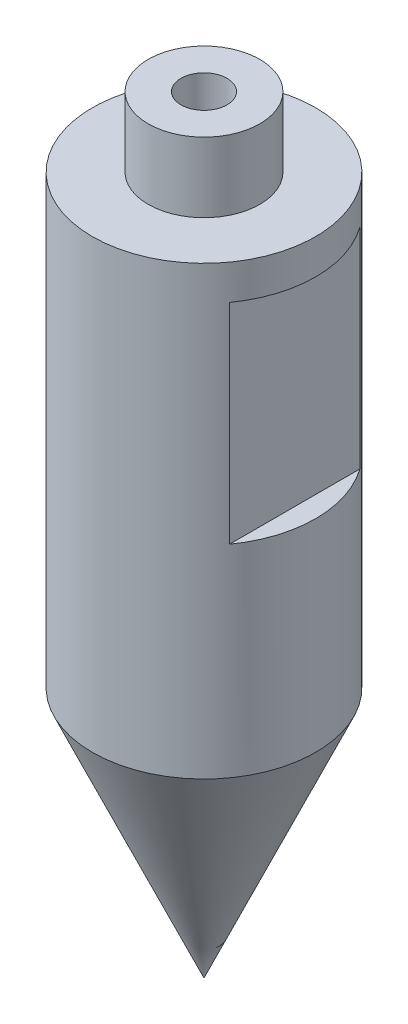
from build123d import *

# Parameters (mm, degrees)
SKETCH_10_R              = 4
EXTRUDE_1_DEPTH          = 5
CUT_EXTRUDE_1_DEPTH      = 52.264022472
CUT_EXTRUDE_1_DEPTH_BACK = 52.264022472
SKETCH_19_W              = 40
SKETCH_19_H              = 15
HOLE_WIZARD_M4_1_D       = 3.3
HOLE_WIZARD_M4_1_DEPTH   = 10.1
HOLE_WIZARD_M4_1_TIP     = 0.991420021


with BuildPart() as part:
    # Sketch 1 → Revolve 1 (revolve)
    with BuildSketch(Plane.XY, mode=Mode.PRIVATE) as revolve_1_sk:
        Polygon((0, 0), (-8, 0), (-8, -32), (0, -50), align=None)
    revolve(revolve_1_sk.sketch.rotate(Axis((0, -50, 0), (0, 1, 0)), 270), axis=Axis((0, -50, 0), (0, 1, 0)))

    # Sketch 10 → Extrude 1 (add)
    with BuildSketch(Plane(origin=(0, 0, 0), x_dir=(1, 0, 0), z_dir=(0, 1, 0))):
        with Locations(Location((0, 0, 0), (0, 0, 270))):
            Circle(SKETCH_10_R)
    extrude(amount=EXTRUDE_1_DEPTH)

    # Sketch 19 → Cut-Extrude 1 (cut, two sides: drawn at the far end of the back side and taken through both)
    with BuildSketch(Plane.XY.offset(-CUT_EXTRUDE_1_DEPTH_BACK)):
        with Locations((26.5, -10)):
            Rectangle(SKETCH_19_W, SKETCH_19_H)
        with Locations((-26.5, -10)):
            Rectangle(SKETCH_19_W, SKETCH_19_H)
    extrude(amount=CUT_EXTRUDE_1_DEPTH + CUT_EXTRUDE_1_DEPTH_BACK, mode=Mode.SUBTRACT)

    # Hole Wizard M4 _1
    with Locations(Plane(origin=(0, 5, 0), x_dir=(1, 0, 0), z_dir=(0, 1, 0))):
        with Locations((0, 0)):
            Hole(HOLE_WIZARD_M4_1_D / 2, depth=HOLE_WIZARD_M4_1_DEPTH)
            with Locations((0, 0, -(HOLE_WIZARD_M4_1_DEPTH + HOLE_WIZARD_M4_1_TIP / 2))):  # 118° drill point
                Cone(0, HOLE_WIZARD_M4_1_D / 2, HOLE_WIZARD_M4_1_TIP, mode=Mode.SUBTRACT)


solid = part.part
